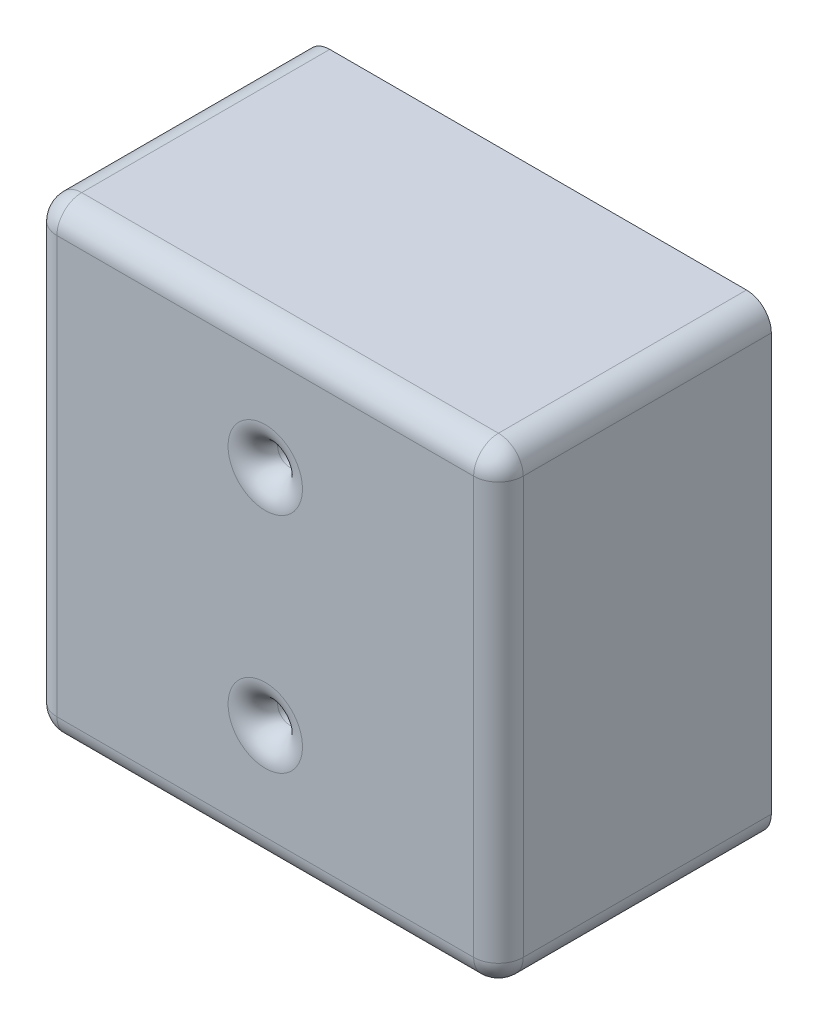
from build123d import *

# Parameters (mm, degrees)
EXTRUSION1_DEPTH        = 55
ESQUISSE2_R             = 3
ENL_V_MAT_EXTRU_1_DEPTH = 20
ESQUISSE3_R             = 2.5
ENL_V_MAT_EXTRU_2_DEPTH = 20
CONG_1_R                = 5


with BuildPart() as part:
    # Esquisse1 → Extrusion1 (new body)
    with BuildSketch(Plane.XY):
        with BuildLine():
            Line((-42, 47), (42, 47))
            ThreePointArc((42, 47), (45.535533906, 45.535533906), (47, 42))
            Line((47, 42), (47, -42))
            ThreePointArc((47, -42), (45.535533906, -45.535533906), (42, -47))
            Line((42, -47), (-42, -47))
            ThreePointArc((-42, -47), (-45.535533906, -45.535533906), (-47, -42))
            Line((-47, -42), (-47, 42))
            ThreePointArc((-47, 42), (-45.535533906, 45.535533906), (-42, 47))
        make_face()
    extrude(amount=EXTRUSION1_DEPTH)

    # Esquisse2 → Enl_v. mat.-Extru.1 (cut)
    with BuildSketch(Plane(origin=(0, 0, 0), x_dir=(-1, 0, 0), z_dir=(0, 0, -1))):
        with Locations((0, 25)):
            Circle(ESQUISSE2_R)
        with Locations((0, -25)):
            Circle(ESQUISSE2_R)
    extrude(amount=-ENL_V_MAT_EXTRU_1_DEPTH, mode=Mode.SUBTRACT)

    # Esquisse3 → Enl_v. mat.-Extru.2 (cut)
    with BuildSketch(Plane.XY.offset(55)):
        with Locations((0, 22.5)):
            Circle(ESQUISSE3_R)
        with Locations((0, -22.5)):
            Circle(ESQUISSE3_R)
    extrude(amount=-ENL_V_MAT_EXTRU_2_DEPTH, mode=Mode.SUBTRACT)

    # Cong_1
    cong_1_edges = [part.edges().sort_by_distance(p)[0] for p in [
        (-45.535533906, -45.535533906, 55),
        (0, -47, 55),
        (45.535533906, -45.535533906, 55),
        (47, 0, 55),
        (45.535533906, 45.535533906, 55),
        (0, 47, 55),
        (-2.5, 22.5, 55),
        (-2.5, -22.5, 55),
        (-45.535533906, 45.535533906, 55),
        (-47, 0, 55),
    ]]
    fillet(cong_1_edges, radius=CONG_1_R)


solid = part.part
